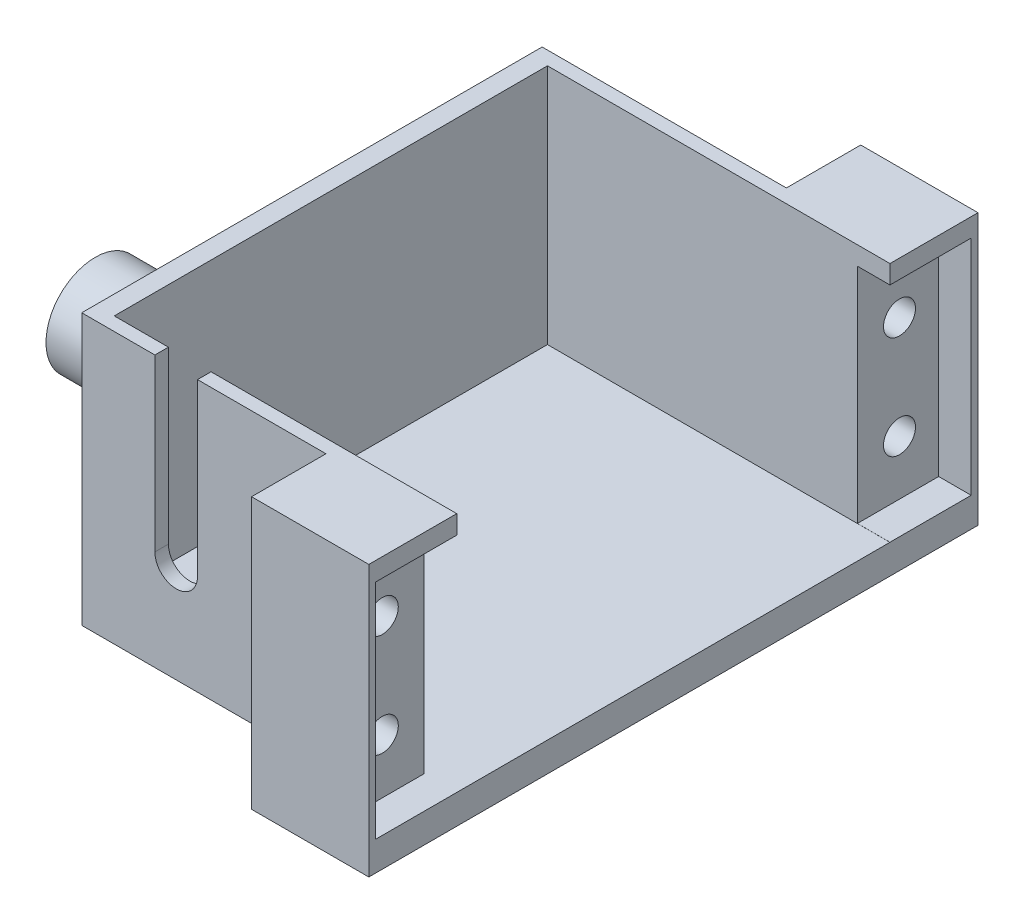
from build123d import *

# Parameters (mm, degrees)
SKETCH1_W           = 33.91
SKETCH1_H           = 57.15
BOSS_EXTRUDE1_DEPTH = 25.4
CUT_EXTRUDE1_REACH  = 53.104
SKETCH2_R           = 1.5
SKETCH3_W           = 40.64
SKETCH3_H           = 22.65
CUT_EXTRUDE2_DEPTH  = 32.13
SKETCH4_W           = 7.62
SKETCH4_H           = 20.9
CUT_EXTRUDE3_DEPTH  = 3.05
CUT_EXTRUDE6_REACH  = 43.823
SKETCH6_W           = 22.91
SKETCH6_H           = 6.98
SKETCH8_R           = 4.625
BOSS_EXTRUDE2_DEPTH = 10
CUT_EXTRUDE7_REACH  = 64.36
SKETCH10_W          = 8
SKETCH10_H          = 8
BOSS_EXTRUDE3_DEPTH = 10
CUT_EXTRUDE8_DEPTH  = 2.3


with BuildPart() as part:
    # Sketch1 → Boss-Extrude1 (new body)
    with BuildSketch(Plane(origin=(0, 0, 0), x_dir=(1, 0, 0), z_dir=(0, 1, 0))):
        Rectangle(SKETCH1_W, SKETCH1_H)
    extrude(amount=BOSS_EXTRUDE1_DEPTH)

    # Sketch2 → Cut-Extrude1 (cut, up to next)
    with BuildSketch(Plane(origin=(16.955, 0, 0), x_dir=(0, 0, -1), z_dir=(1, 0, 0)), mode=Mode.PRIVATE) as cut_extrude1_sk1:
        with Locations((-24.26, 17.525)):
            Circle(SKETCH2_R)
    cut_extrude1_tool1 = extrude(cut_extrude1_sk1.sketch, amount=-CUT_EXTRUDE1_REACH, mode=Mode.PRIVATE) & part.part
    # Sketch2 → Cut-Extrude1 (cut, up to next)
    with BuildSketch(Plane(origin=(16.955, 0, 0), x_dir=(0, 0, -1), z_dir=(1, 0, 0)), mode=Mode.PRIVATE) as cut_extrude1_sk2:
        with Locations((-24.26, 7.875)):
            Circle(SKETCH2_R)
    cut_extrude1_tool2 = extrude(cut_extrude1_sk2.sketch, amount=-CUT_EXTRUDE1_REACH, mode=Mode.PRIVATE) & part.part
    # Sketch2 → Cut-Extrude1 (cut, up to next)
    with BuildSketch(Plane(origin=(16.955, 0, 0), x_dir=(0, 0, -1), z_dir=(1, 0, 0)), mode=Mode.PRIVATE) as cut_extrude1_sk3:
        with Locations((24.26, 7.875)):
            Circle(SKETCH2_R)
    cut_extrude1_tool3 = extrude(cut_extrude1_sk3.sketch, amount=-CUT_EXTRUDE1_REACH, mode=Mode.PRIVATE) & part.part
    # Sketch2 → Cut-Extrude1 (cut, up to next)
    with BuildSketch(Plane(origin=(16.955, 0, 0), x_dir=(0, 0, -1), z_dir=(1, 0, 0)), mode=Mode.PRIVATE) as cut_extrude1_sk4:
        with Locations((24.26, 17.525)):
            Circle(SKETCH2_R)
    cut_extrude1_tool4 = extrude(cut_extrude1_sk4.sketch, amount=-CUT_EXTRUDE1_REACH, mode=Mode.PRIVATE) & part.part
    add(cut_extrude1_tool1.solids().sort_by_distance((16.955, 17.525, 24.26))[0], mode=Mode.SUBTRACT)
    add(cut_extrude1_tool2.solids().sort_by_distance((16.955, 7.875, 24.26))[0], mode=Mode.SUBTRACT)
    add(cut_extrude1_tool3.solids().sort_by_distance((16.955, 7.875, -24.26))[0], mode=Mode.SUBTRACT)
    add(cut_extrude1_tool4.solids().sort_by_distance((16.955, 17.525, -24.26))[0], mode=Mode.SUBTRACT)

    # Sketch3 → Cut-Extrude2 (cut)
    with BuildSketch(Plane(origin=(16.955, 0, 0), x_dir=(0, 0, -1), z_dir=(1, 0, 0))):
        with Locations((-0.005, 14.075)):
            Rectangle(SKETCH3_W, SKETCH3_H)
    extrude(amount=-CUT_EXTRUDE2_DEPTH, mode=Mode.SUBTRACT)

    # Sketch4 → Cut-Extrude3 (cut)
    with BuildSketch(Plane(origin=(16.955, 0, 0), x_dir=(0, 0, -1), z_dir=(1, 0, 0))):
        with Locations((-24.125, 13.2)):
            Rectangle(SKETCH4_W, SKETCH4_H)
        Polygon((20.313915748, 2.757997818), (27.933915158, 2.760997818), (27.925686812, 23.660996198), (20.305687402, 23.657996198), align=None)
    extrude(amount=-CUT_EXTRUDE3_DEPTH, mode=Mode.SUBTRACT)

    # Sketch6 → Cut-Extrude6 (cut, up to next)
    with BuildSketch(Plane(origin=(0, 25.4, 0), x_dir=(1, 0, 0), z_dir=(0, 1, 0)), mode=Mode.PRIVATE) as cut_extrude6_sk1:
        with Locations((-5.5, -25.085)):
            Rectangle(SKETCH6_W, SKETCH6_H)
    cut_extrude6_tool1 = extrude(cut_extrude6_sk1.sketch, amount=-CUT_EXTRUDE6_REACH, mode=Mode.PRIVATE) & part.part
    # Sketch6 → Cut-Extrude6 (cut, up to next)
    with BuildSketch(Plane(origin=(0, 25.4, 0), x_dir=(1, 0, 0), z_dir=(0, 1, 0)), mode=Mode.PRIVATE) as cut_extrude6_sk2:
        with Locations((-5.5, 25.085)):
            Rectangle(SKETCH6_W, SKETCH6_H)
    cut_extrude6_tool2 = extrude(cut_extrude6_sk2.sketch, amount=-CUT_EXTRUDE6_REACH, mode=Mode.PRIVATE) & part.part
    add(cut_extrude6_tool1.solids().sort_by_distance((-5.5, 25.4, 25.085))[0], mode=Mode.SUBTRACT)
    add(cut_extrude6_tool2.solids().sort_by_distance((-5.5, 25.4, -25.085))[0], mode=Mode.SUBTRACT)

    # Sketch8 → Boss-Extrude2 (add)
    with BuildSketch(Plane.ZY.offset(16.955)):
        with Locations(Location((10.325, 14.65, 0), (0, 0, 180))):
            Circle(SKETCH8_R)
    extrude(amount=BOSS_EXTRUDE2_DEPTH)

    # Sketch9 → Cut-Extrude7 (cut, up to next)
    with BuildSketch(Plane.XY.offset(21.595), mode=Mode.PRIVATE) as cut_extrude7_sk1:
        with BuildLine():
            Line((-10.095, 25.4), (-10.095, 9.4))
            ThreePointArc((-10.095, 9.4), (-8.095, 7.4), (-6.095, 9.4))
            Line((-6.095, 9.4), (-6.095, 25.4))
            Line((-6.095, 25.4), (-10.095, 25.4))
        make_face()
    cut_extrude7_tool1 = extrude(cut_extrude7_sk1.sketch, amount=-CUT_EXTRUDE7_REACH, mode=Mode.PRIVATE) & part.part
    add(cut_extrude7_tool1.solids().sort_by_distance((-8.095, 16.608931, 21.595))[0], mode=Mode.SUBTRACT)

    # Sketch10 → Boss-Extrude3 (add)
    with BuildSketch(Plane.XZ):
        Rectangle(SKETCH10_W, SKETCH10_H)
    extrude(amount=BOSS_EXTRUDE3_DEPTH)

    # Sketch11 → Cut-Extrude8 (cut)
    with BuildSketch(Plane.ZY.offset(-5.955)):
        Polygon((-27.01, 15.93728676), (-24.26, 14.349573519), (-21.51, 15.93728676), (-21.51, 19.11271324), (-24.26, 20.700426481), (-27.01, 19.11271324), align=None)
        Polygon((-27.01, 6.28728676), (-27.01, 9.46271324), (-24.26, 11.050426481), (-21.51, 9.46271324), (-21.51, 6.28728676), (-24.26, 4.699573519), align=None)
        Polygon((24.26, 4.699573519), (27.01, 6.28728676), (27.01, 9.46271324), (24.26, 11.050426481), (21.51, 9.46271324), (21.51, 6.28728676), align=None)
        Polygon((27.01, 19.11271324), (27.01, 15.93728676), (24.26, 14.349573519), (21.51, 15.93728676), (21.51, 19.11271324), (24.26, 20.700426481), align=None)
    extrude(amount=-CUT_EXTRUDE8_DEPTH, mode=Mode.SUBTRACT)


solid = part.part
